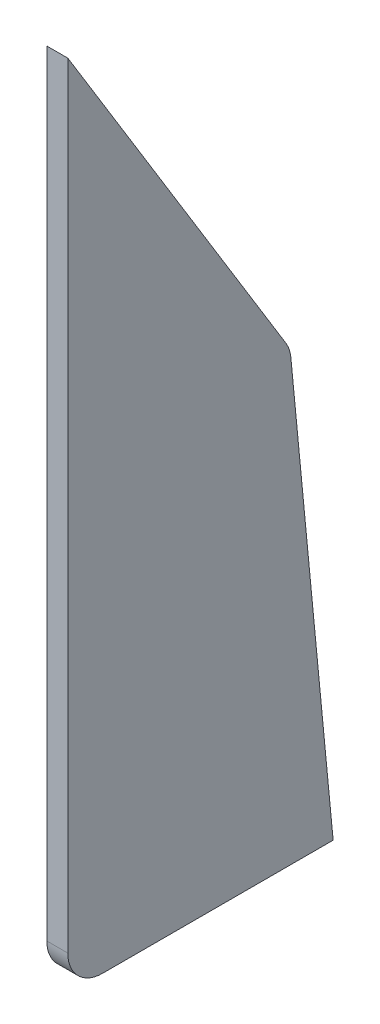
ISO-10303-21;
HEADER;
FILE_DESCRIPTION(('STEP AP214'),'2;1');
FILE_NAME('part.step','',(''),(''),'','','');
FILE_SCHEMA(('AUTOMOTIVE_DESIGN { 1 0 10303 214 1 1 1 1 }'));
ENDSEC;
DATA;
#1=APPLICATION_CONTEXT('core data for automotive mechanical design processes');
#2=APPLICATION_PROTOCOL_DEFINITION('international standard','automotive_design',2000,#1);
#3=PRODUCT_CONTEXT('',#1,'mechanical');
#4=PRODUCT('Part','Part','',(#3));
#5=PRODUCT_RELATED_PRODUCT_CATEGORY('part','',(#4));
#6=PRODUCT_DEFINITION_FORMATION('','',#4);
#7=PRODUCT_DEFINITION_CONTEXT('part definition',#1,'design');
#8=PRODUCT_DEFINITION('design','',#6,#7);
#9=PRODUCT_DEFINITION_SHAPE('','',#8);
#10=(LENGTH_UNIT() NAMED_UNIT(*) SI_UNIT(.MILLI.,.METRE.));
#11=(NAMED_UNIT(*) PLANE_ANGLE_UNIT() SI_UNIT($,.RADIAN.));
#12=(NAMED_UNIT(*) SI_UNIT($,.STERADIAN.) SOLID_ANGLE_UNIT());
#13=UNCERTAINTY_MEASURE_WITH_UNIT(LENGTH_MEASURE(1.E-05),#10,'distance_accuracy_value','');
#14=(GEOMETRIC_REPRESENTATION_CONTEXT(3) GLOBAL_UNCERTAINTY_ASSIGNED_CONTEXT((#13)) GLOBAL_UNIT_ASSIGNED_CONTEXT((#10,
#11,#12)) REPRESENTATION_CONTEXT('',''));
#15=CARTESIAN_POINT('',(0.,0.,0.));
#16=DIRECTION('',(0.,0.,1.));
#17=DIRECTION('',(1.,0.,0.));
#18=AXIS2_PLACEMENT_3D('',#15,#16,#17);
#19=CARTESIAN_POINT('',(3.,-111.,0.));
#20=DIRECTION('',(0.,0.,-1.));
#21=DIRECTION('',(-1.,0.,0.));
#22=AXIS2_PLACEMENT_3D('',#19,#20,#21);
#23=PLANE('',#22);
#24=DIRECTION('',(0.,-1.,0.));
#25=VECTOR('',#24,1.);
#26=CARTESIAN_POINT('',(0.,-111.,0.));
#27=LINE('',#26,#25);
#28=CARTESIAN_POINT('',(0.,0.,0.));
#29=VERTEX_POINT('',#28);
#30=CARTESIAN_POINT('',(0.,-111.,0.));
#31=VERTEX_POINT('',#30);
#32=EDGE_CURVE('E86',#29,#31,#27,.T.);
#33=ORIENTED_EDGE('',*,*,#32,.T.);
#34=DIRECTION('',(-1.,0.,0.));
#35=VECTOR('',#34,1.);
#36=CARTESIAN_POINT('',(3.,-111.,0.));
#37=LINE('',#36,#35);
#38=CARTESIAN_POINT('',(3.,-111.,0.));
#39=VERTEX_POINT('',#38);
#40=EDGE_CURVE('E11',#39,#31,#37,.T.);
#41=ORIENTED_EDGE('',*,*,#40,.F.);
#42=DIRECTION('',(0.,-1.,0.));
#43=VECTOR('',#42,1.);
#44=CARTESIAN_POINT('',(3.,-111.,0.));
#45=LINE('',#44,#43);
#46=CARTESIAN_POINT('',(3.,0.,0.));
#47=VERTEX_POINT('',#46);
#48=EDGE_CURVE('E109',#47,#39,#45,.T.);
#49=ORIENTED_EDGE('',*,*,#48,.F.);
#50=DIRECTION('',(-1.,0.,0.));
#51=VECTOR('',#50,1.);
#52=CARTESIAN_POINT('',(3.,0.,0.));
#53=LINE('',#52,#51);
#54=EDGE_CURVE('E99',#47,#29,#53,.T.);
#55=ORIENTED_EDGE('',*,*,#54,.T.);
#56=EDGE_LOOP('',(#33,#41,#49,#55));
#57=FACE_BOUND('',#56,.T.);
#58=ADVANCED_FACE('F30',(#57),#23,.F.);
#59=CARTESIAN_POINT('',(3.,-111.,-5.));
#60=DIRECTION('',(-1.,0.,0.));
#61=DIRECTION('',(0.,0.,1.));
#62=AXIS2_PLACEMENT_3D('',#59,#60,#61);
#63=CYLINDRICAL_SURFACE('',#62,5.);
#64=CARTESIAN_POINT('',(0.,-111.,-5.));
#65=DIRECTION('',(1.,0.,0.));
#66=DIRECTION('',(0.,0.,1.));
#67=AXIS2_PLACEMENT_3D('',#64,#65,#66);
#68=CIRCLE('',#67,5.);
#69=CARTESIAN_POINT('',(0.,-116.,-5.));
#70=VERTEX_POINT('',#69);
#71=EDGE_CURVE('E82',#31,#70,#68,.T.);
#72=ORIENTED_EDGE('',*,*,#71,.T.);
#73=DIRECTION('',(-1.,0.,0.));
#74=VECTOR('',#73,1.);
#75=CARTESIAN_POINT('',(3.,-116.,-5.));
#76=LINE('',#75,#74);
#77=CARTESIAN_POINT('',(3.,-116.,-5.));
#78=VERTEX_POINT('',#77);
#79=EDGE_CURVE('E37',#78,#70,#76,.T.);
#80=ORIENTED_EDGE('',*,*,#79,.F.);
#81=CARTESIAN_POINT('',(3.,-111.,-5.));
#82=DIRECTION('',(1.,0.,0.));
#83=DIRECTION('',(0.,0.,1.));
#84=AXIS2_PLACEMENT_3D('',#81,#82,#83);
#85=CIRCLE('',#84,5.);
#86=EDGE_CURVE('E95',#39,#78,#85,.T.);
#87=ORIENTED_EDGE('',*,*,#86,.F.);
#88=ORIENTED_EDGE('',*,*,#40,.T.);
#89=EDGE_LOOP('',(#72,#80,#87,#88));
#90=FACE_BOUND('',#89,.T.);
#91=ADVANCED_FACE('F94',(#90),#63,.T.);
#92=CARTESIAN_POINT('',(3.,-116.,-38.));
#93=DIRECTION('',(0.,1.,0.));
#94=DIRECTION('',(0.,0.,1.));
#95=AXIS2_PLACEMENT_3D('',#92,#93,#94);
#96=PLANE('',#95);
#97=DIRECTION('',(0.,0.,-1.));
#98=VECTOR('',#97,1.);
#99=CARTESIAN_POINT('',(0.,-116.,-38.));
#100=LINE('',#99,#98);
#101=CARTESIAN_POINT('',(0.,-116.,-38.));
#102=VERTEX_POINT('',#101);
#103=EDGE_CURVE('E88',#70,#102,#100,.T.);
#104=ORIENTED_EDGE('',*,*,#103,.T.);
#105=DIRECTION('',(-1.,0.,0.));
#106=VECTOR('',#105,1.);
#107=CARTESIAN_POINT('',(3.,-116.,-38.));
#108=LINE('',#107,#106);
#109=CARTESIAN_POINT('',(3.,-116.,-38.));
#110=VERTEX_POINT('',#109);
#111=EDGE_CURVE('E125',#110,#102,#108,.T.);
#112=ORIENTED_EDGE('',*,*,#111,.F.);
#113=DIRECTION('',(0.,0.,-1.));
#114=VECTOR('',#113,1.);
#115=CARTESIAN_POINT('',(3.,-116.,-38.));
#116=LINE('',#115,#114);
#117=EDGE_CURVE('E112',#78,#110,#116,.T.);
#118=ORIENTED_EDGE('',*,*,#117,.F.);
#119=ORIENTED_EDGE('',*,*,#79,.T.);
#120=EDGE_LOOP('',(#104,#112,#118,#119));
#121=FACE_BOUND('',#120,.T.);
#122=ADVANCED_FACE('F129',(#121),#96,.F.);
#123=CARTESIAN_POINT('',(3.,-53.0945456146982,-31.9428936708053));
#124=DIRECTION('',(0.,-0.0958457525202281,0.995396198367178));
#125=DIRECTION('',(0.,-0.995396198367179,-0.0958457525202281));
#126=AXIS2_PLACEMENT_3D('',#123,#124,#125);
#127=PLANE('',#126);
#128=DIRECTION('',(0.,0.995396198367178,0.0958457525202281));
#129=VECTOR('',#128,1.);
#130=CARTESIAN_POINT('',(0.,-53.0945456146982,-31.9428936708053));
#131=LINE('',#130,#129);
#132=CARTESIAN_POINT('',(0.,-53.0945456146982,-31.9428936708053));
#133=VERTEX_POINT('',#132);
#134=EDGE_CURVE('E103',#102,#133,#131,.T.);
#135=ORIENTED_EDGE('',*,*,#134,.T.);
#136=DIRECTION('',(-1.,0.,0.));
#137=VECTOR('',#136,1.);
#138=CARTESIAN_POINT('',(3.,-53.0945456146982,-31.9428936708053));
#139=LINE('',#138,#137);
#140=CARTESIAN_POINT('',(3.,-53.0945456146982,-31.9428936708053));
#141=VERTEX_POINT('',#140);
#142=EDGE_CURVE('E122',#141,#133,#139,.T.);
#143=ORIENTED_EDGE('',*,*,#142,.F.);
#144=DIRECTION('',(0.,0.995396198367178,0.0958457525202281));
#145=VECTOR('',#144,1.);
#146=CARTESIAN_POINT('',(3.,-53.0945456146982,-31.9428936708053));
#147=LINE('',#146,#145);
#148=EDGE_CURVE('E114',#110,#141,#147,.T.);
#149=ORIENTED_EDGE('',*,*,#148,.F.);
#150=ORIENTED_EDGE('',*,*,#111,.T.);
#151=EDGE_LOOP('',(#135,#143,#149,#150));
#152=FACE_BOUND('',#151,.T.);
#153=ADVANCED_FACE('F135',(#152),#127,.F.);
#154=CARTESIAN_POINT('',(3.,-53.5737743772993,-26.9659126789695));
#155=DIRECTION('',(-1.,0.,0.));
#156=DIRECTION('',(0.,0.,1.));
#157=AXIS2_PLACEMENT_3D('',#154,#155,#156);
#158=CYLINDRICAL_SURFACE('',#157,5.);
#159=CARTESIAN_POINT('',(0.,-53.5737743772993,-26.9659126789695));
#160=DIRECTION('',(1.,0.,0.));
#161=DIRECTION('',(0.,0.,1.));
#162=AXIS2_PLACEMENT_3D('',#159,#160,#161);
#163=CIRCLE('',#162,5.);
#164=CARTESIAN_POINT('',(0.,-50.9612815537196,-31.2291135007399));
#165=VERTEX_POINT('',#164);
#166=EDGE_CURVE('E105',#133,#165,#163,.T.);
#167=ORIENTED_EDGE('',*,*,#166,.T.);
#168=DIRECTION('',(-1.,0.,0.));
#169=VECTOR('',#168,1.);
#170=CARTESIAN_POINT('',(3.,-50.9612815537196,-31.2291135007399));
#171=LINE('',#170,#169);
#172=CARTESIAN_POINT('',(3.,-50.9612815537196,-31.2291135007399));
#173=VERTEX_POINT('',#172);
#174=EDGE_CURVE('E119',#173,#165,#171,.T.);
#175=ORIENTED_EDGE('',*,*,#174,.F.);
#176=CARTESIAN_POINT('',(3.,-53.5737743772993,-26.9659126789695));
#177=DIRECTION('',(1.,0.,0.));
#178=DIRECTION('',(0.,0.,1.));
#179=AXIS2_PLACEMENT_3D('',#176,#177,#178);
#180=CIRCLE('',#179,5.);
#181=EDGE_CURVE('E49',#141,#173,#180,.T.);
#182=ORIENTED_EDGE('',*,*,#181,.F.);
#183=ORIENTED_EDGE('',*,*,#142,.T.);
#184=EDGE_LOOP('',(#167,#175,#182,#183));
#185=FACE_BOUND('',#184,.T.);
#186=ADVANCED_FACE('F138',(#185),#158,.T.);
#187=CARTESIAN_POINT('',(3.,0.,0.));
#188=DIRECTION('',(0.,-0.522498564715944,0.852640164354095));
#189=DIRECTION('',(0.,-0.852640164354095,-0.522498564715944));
#190=AXIS2_PLACEMENT_3D('',#187,#188,#189);
#191=PLANE('',#190);
#192=DIRECTION('',(0.,0.852640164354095,0.522498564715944));
#193=VECTOR('',#192,1.);
#194=CARTESIAN_POINT('',(0.,0.,0.));
#195=LINE('',#194,#193);
#196=EDGE_CURVE('E107',#165,#29,#195,.T.);
#197=ORIENTED_EDGE('',*,*,#196,.T.);
#198=ORIENTED_EDGE('',*,*,#54,.F.);
#199=DIRECTION('',(0.,0.852640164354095,0.522498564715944));
#200=VECTOR('',#199,1.);
#201=CARTESIAN_POINT('',(3.,0.,0.));
#202=LINE('',#201,#200);
#203=EDGE_CURVE('E44',#173,#47,#202,.T.);
#204=ORIENTED_EDGE('',*,*,#203,.F.);
#205=ORIENTED_EDGE('',*,*,#174,.T.);
#206=EDGE_LOOP('',(#197,#198,#204,#205));
#207=FACE_BOUND('',#206,.T.);
#208=ADVANCED_FACE('F140',(#207),#191,.F.);
#209=CARTESIAN_POINT('',(3.,-53.5737743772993,-26.9659126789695));
#210=DIRECTION('',(-1.,0.,0.));
#211=DIRECTION('',(0.,0.,1.));
#212=AXIS2_PLACEMENT_3D('',#209,#210,#211);
#213=PLANE('',#212);
#214=ORIENTED_EDGE('',*,*,#48,.T.);
#215=ORIENTED_EDGE('',*,*,#86,.T.);
#216=ORIENTED_EDGE('',*,*,#117,.T.);
#217=ORIENTED_EDGE('',*,*,#148,.T.);
#218=ORIENTED_EDGE('',*,*,#181,.T.);
#219=ORIENTED_EDGE('',*,*,#203,.T.);
#220=EDGE_LOOP('',(#214,#215,#216,#217,#218,#219));
#221=FACE_BOUND('',#220,.T.);
#222=ADVANCED_FACE('F132',(#221),#213,.F.);
#223=CARTESIAN_POINT('',(0.,-53.5737743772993,-26.9659126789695));
#224=DIRECTION('',(-1.,0.,0.));
#225=DIRECTION('',(0.,0.,1.));
#226=AXIS2_PLACEMENT_3D('',#223,#224,#225);
#227=PLANE('',#226);
#228=ORIENTED_EDGE('',*,*,#32,.F.);
#229=ORIENTED_EDGE('',*,*,#196,.F.);
#230=ORIENTED_EDGE('',*,*,#166,.F.);
#231=ORIENTED_EDGE('',*,*,#134,.F.);
#232=ORIENTED_EDGE('',*,*,#103,.F.);
#233=ORIENTED_EDGE('',*,*,#71,.F.);
#234=EDGE_LOOP('',(#228,#229,#230,#231,#232,#233));
#235=FACE_BOUND('',#234,.T.);
#236=ADVANCED_FACE('F83',(#235),#227,.T.);
#237=CLOSED_SHELL('',(#58,#91,#122,#153,#186,#208,#222,#236));
#238=MANIFOLD_SOLID_BREP('B2',#237);
#239=ADVANCED_BREP_SHAPE_REPRESENTATION('',(#18,#238),#14);
#240=SHAPE_DEFINITION_REPRESENTATION(#9,#239);
ENDSEC;
END-ISO-10303-21;
